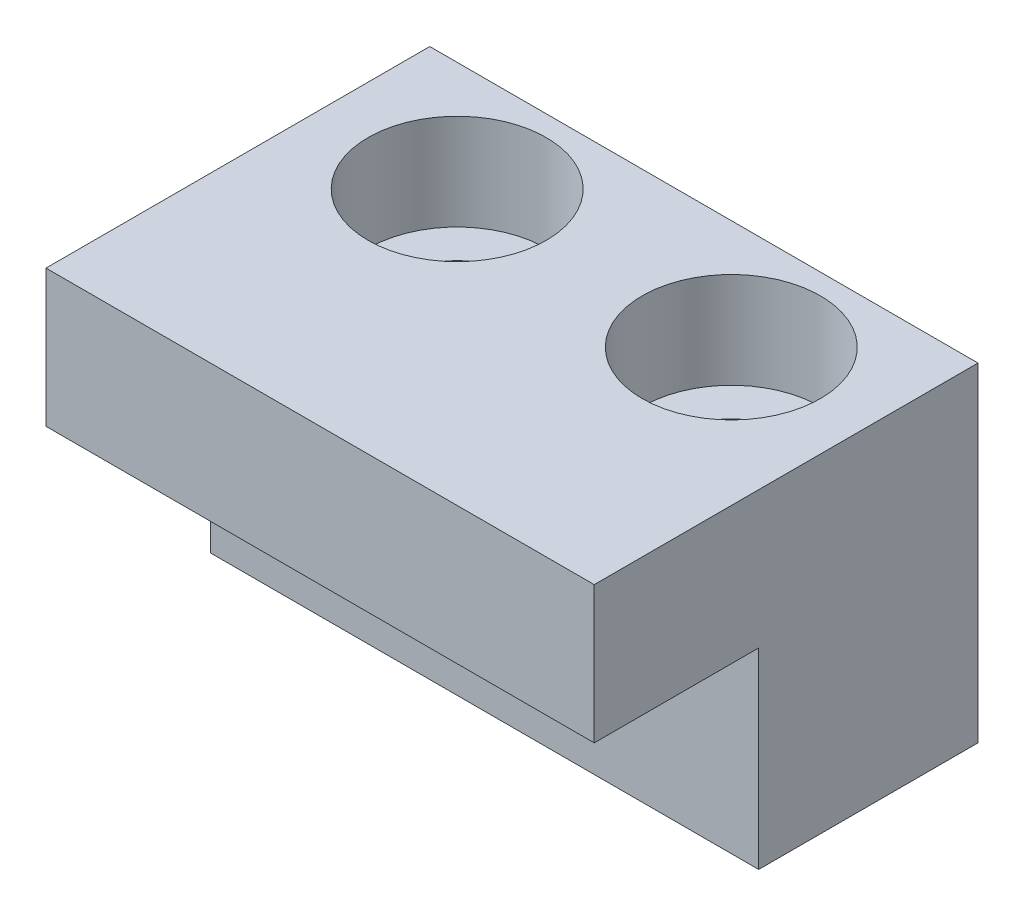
ISO-10303-21;
HEADER;
FILE_DESCRIPTION(('STEP AP214'),'2;1');
FILE_NAME('part.step','',(''),(''),'','','');
FILE_SCHEMA(('AUTOMOTIVE_DESIGN { 1 0 10303 214 1 1 1 1 }'));
ENDSEC;
DATA;
#1=APPLICATION_CONTEXT('core data for automotive mechanical design processes');
#2=APPLICATION_PROTOCOL_DEFINITION('international standard','automotive_design',2000,#1);
#3=PRODUCT_CONTEXT('',#1,'mechanical');
#4=PRODUCT('Part','Part','',(#3));
#5=PRODUCT_RELATED_PRODUCT_CATEGORY('part','',(#4));
#6=PRODUCT_DEFINITION_FORMATION('','',#4);
#7=PRODUCT_DEFINITION_CONTEXT('part definition',#1,'design');
#8=PRODUCT_DEFINITION('design','',#6,#7);
#9=PRODUCT_DEFINITION_SHAPE('','',#8);
#10=(LENGTH_UNIT() NAMED_UNIT(*) SI_UNIT(.MILLI.,.METRE.));
#11=(NAMED_UNIT(*) PLANE_ANGLE_UNIT() SI_UNIT($,.RADIAN.));
#12=(NAMED_UNIT(*) SI_UNIT($,.STERADIAN.) SOLID_ANGLE_UNIT());
#13=UNCERTAINTY_MEASURE_WITH_UNIT(LENGTH_MEASURE(1.E-05),#10,'distance_accuracy_value','');
#14=(GEOMETRIC_REPRESENTATION_CONTEXT(3) GLOBAL_UNCERTAINTY_ASSIGNED_CONTEXT((#13)) GLOBAL_UNIT_ASSIGNED_CONTEXT((#10,
#11,#12)) REPRESENTATION_CONTEXT('',''));
#15=CARTESIAN_POINT('',(0.,0.,0.));
#16=DIRECTION('',(0.,0.,1.));
#17=DIRECTION('',(1.,0.,0.));
#18=AXIS2_PLACEMENT_3D('',#15,#16,#17);
#19=CARTESIAN_POINT('',(15.,0.,4.));
#20=DIRECTION('',(0.,1.,0.));
#21=DIRECTION('',(0.,0.,1.));
#22=AXIS2_PLACEMENT_3D('',#19,#20,#21);
#23=CYLINDRICAL_SURFACE('',#22,1.75);
#24=CARTESIAN_POINT('',(15.,0.,4.));
#25=DIRECTION('',(0.,1.,0.));
#26=DIRECTION('',(0.,0.,1.));
#27=AXIS2_PLACEMENT_3D('',#24,#25,#26);
#28=CIRCLE('',#27,1.75);
#29=CARTESIAN_POINT('',(15.,0.,5.75));
#30=VERTEX_POINT('',#29);
#31=EDGE_CURVE('E113',#30,#30,#28,.T.);
#32=ORIENTED_EDGE('',*,*,#31,.F.);
#33=EDGE_LOOP('',(#32));
#34=FACE_BOUND('',#33,.T.);
#35=CARTESIAN_POINT('',(15.,8.5,4.));
#36=DIRECTION('',(0.,1.,0.));
#37=DIRECTION('',(0.,0.,1.));
#38=AXIS2_PLACEMENT_3D('',#35,#36,#37);
#39=CIRCLE('',#38,1.75);
#40=CARTESIAN_POINT('',(15.,8.5,5.75));
#41=VERTEX_POINT('',#40);
#42=EDGE_CURVE('E36',#41,#41,#39,.F.);
#43=ORIENTED_EDGE('',*,*,#42,.F.);
#44=EDGE_LOOP('',(#43));
#45=FACE_BOUND('',#44,.T.);
#46=ADVANCED_FACE('F32',(#34,#45),#23,.F.);
#47=CARTESIAN_POINT('',(5.,0.,4.));
#48=DIRECTION('',(0.,1.,0.));
#49=DIRECTION('',(0.,0.,1.));
#50=AXIS2_PLACEMENT_3D('',#47,#48,#49);
#51=CYLINDRICAL_SURFACE('',#50,1.75);
#52=CARTESIAN_POINT('',(5.,0.,4.));
#53=DIRECTION('',(0.,1.,0.));
#54=DIRECTION('',(0.,0.,1.));
#55=AXIS2_PLACEMENT_3D('',#52,#53,#54);
#56=CIRCLE('',#55,1.75);
#57=CARTESIAN_POINT('',(5.,0.,5.75));
#58=VERTEX_POINT('',#57);
#59=EDGE_CURVE('E118',#58,#58,#56,.T.);
#60=ORIENTED_EDGE('',*,*,#59,.F.);
#61=EDGE_LOOP('',(#60));
#62=FACE_BOUND('',#61,.T.);
#63=CARTESIAN_POINT('',(5.,8.5,4.));
#64=DIRECTION('',(0.,1.,0.));
#65=DIRECTION('',(0.,0.,1.));
#66=AXIS2_PLACEMENT_3D('',#63,#64,#65);
#67=CIRCLE('',#66,1.75);
#68=CARTESIAN_POINT('',(5.,8.5,5.75));
#69=VERTEX_POINT('',#68);
#70=EDGE_CURVE('E111',#69,#69,#67,.F.);
#71=ORIENTED_EDGE('',*,*,#70,.F.);
#72=EDGE_LOOP('',(#71));
#73=FACE_BOUND('',#72,.T.);
#74=ADVANCED_FACE('F175',(#62,#73),#51,.F.);
#75=CARTESIAN_POINT('',(0.,0.,14.));
#76=DIRECTION('',(0.,1.,0.));
#77=DIRECTION('',(0.,0.,1.));
#78=AXIS2_PLACEMENT_3D('',#75,#76,#77);
#79=PLANE('',#78);
#80=ORIENTED_EDGE('',*,*,#31,.T.);
#81=EDGE_LOOP('',(#80));
#82=FACE_BOUND('',#81,.T.);
#83=ORIENTED_EDGE('',*,*,#59,.T.);
#84=EDGE_LOOP('',(#83));
#85=FACE_BOUND('',#84,.T.);
#86=DIRECTION('',(0.,0.,-1.));
#87=VECTOR('',#86,1.);
#88=CARTESIAN_POINT('',(20.,0.,14.));
#89=LINE('',#88,#87);
#90=CARTESIAN_POINT('',(20.,0.,8.));
#91=VERTEX_POINT('',#90);
#92=CARTESIAN_POINT('',(20.,0.,0.));
#93=VERTEX_POINT('',#92);
#94=EDGE_CURVE('E106',#91,#93,#89,.T.);
#95=ORIENTED_EDGE('',*,*,#94,.F.);
#96=DIRECTION('',(-1.,0.,0.));
#97=VECTOR('',#96,1.);
#98=CARTESIAN_POINT('',(54.0036762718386,0.,8.));
#99=LINE('',#98,#97);
#100=CARTESIAN_POINT('',(0.,0.,8.));
#101=VERTEX_POINT('',#100);
#102=EDGE_CURVE('E103',#91,#101,#99,.T.);
#103=ORIENTED_EDGE('',*,*,#102,.T.);
#104=DIRECTION('',(0.,0.,-1.));
#105=VECTOR('',#104,1.);
#106=CARTESIAN_POINT('',(0.,0.,14.));
#107=LINE('',#106,#105);
#108=CARTESIAN_POINT('',(0.,0.,0.));
#109=VERTEX_POINT('',#108);
#110=EDGE_CURVE('E93',#101,#109,#107,.T.);
#111=ORIENTED_EDGE('',*,*,#110,.T.);
#112=DIRECTION('',(1.,0.,0.));
#113=VECTOR('',#112,1.);
#114=CARTESIAN_POINT('',(0.,0.,0.));
#115=LINE('',#114,#113);
#116=EDGE_CURVE('E138',#109,#93,#115,.T.);
#117=ORIENTED_EDGE('',*,*,#116,.T.);
#118=EDGE_LOOP('',(#95,#103,#111,#117));
#119=FACE_BOUND('',#118,.T.);
#120=ADVANCED_FACE('F34',(#82,#85,#119),#79,.F.);
#121=CARTESIAN_POINT('',(20.,0.,14.));
#122=DIRECTION('',(-1.,0.,0.));
#123=DIRECTION('',(0.,0.,1.));
#124=AXIS2_PLACEMENT_3D('',#121,#122,#123);
#125=PLANE('',#124);
#126=DIRECTION('',(0.,0.,-1.));
#127=VECTOR('',#126,1.);
#128=CARTESIAN_POINT('',(20.,7.,14.));
#129=LINE('',#128,#127);
#130=CARTESIAN_POINT('',(20.,7.,14.));
#131=VERTEX_POINT('',#130);
#132=CARTESIAN_POINT('',(20.,7.,8.));
#133=VERTEX_POINT('',#132);
#134=EDGE_CURVE('E49',#131,#133,#129,.T.);
#135=ORIENTED_EDGE('',*,*,#134,.T.);
#136=DIRECTION('',(0.,-1.,0.));
#137=VECTOR('',#136,1.);
#138=CARTESIAN_POINT('',(20.,0.,8.));
#139=LINE('',#138,#137);
#140=EDGE_CURVE('E53',#133,#91,#139,.T.);
#141=ORIENTED_EDGE('',*,*,#140,.T.);
#142=ORIENTED_EDGE('',*,*,#94,.T.);
#143=DIRECTION('',(0.,1.,0.));
#144=VECTOR('',#143,1.);
#145=CARTESIAN_POINT('',(20.,0.,0.));
#146=LINE('',#145,#144);
#147=CARTESIAN_POINT('',(20.,12.,0.));
#148=VERTEX_POINT('',#147);
#149=EDGE_CURVE('E145',#93,#148,#146,.T.);
#150=ORIENTED_EDGE('',*,*,#149,.T.);
#151=DIRECTION('',(0.,0.,-1.));
#152=VECTOR('',#151,1.);
#153=CARTESIAN_POINT('',(20.,12.,14.));
#154=LINE('',#153,#152);
#155=CARTESIAN_POINT('',(20.,12.,14.));
#156=VERTEX_POINT('',#155);
#157=EDGE_CURVE('E108',#156,#148,#154,.T.);
#158=ORIENTED_EDGE('',*,*,#157,.F.);
#159=DIRECTION('',(0.,1.,0.));
#160=VECTOR('',#159,1.);
#161=CARTESIAN_POINT('',(20.,0.,14.));
#162=LINE('',#161,#160);
#163=EDGE_CURVE('E139',#131,#156,#162,.T.);
#164=ORIENTED_EDGE('',*,*,#163,.F.);
#165=EDGE_LOOP('',(#135,#141,#142,#150,#158,#164));
#166=FACE_BOUND('',#165,.T.);
#167=ADVANCED_FACE('F167',(#166),#125,.F.);
#168=CARTESIAN_POINT('',(20.,12.,14.));
#169=DIRECTION('',(0.,-1.,0.));
#170=DIRECTION('',(0.,0.,-1.));
#171=AXIS2_PLACEMENT_3D('',#168,#169,#170);
#172=PLANE('',#171);
#173=CARTESIAN_POINT('',(15.,12.,4.));
#174=DIRECTION('',(0.,1.,0.));
#175=DIRECTION('',(0.,0.,1.));
#176=AXIS2_PLACEMENT_3D('',#173,#174,#175);
#177=CIRCLE('',#176,3.25);
#178=CARTESIAN_POINT('',(15.,12.,7.25));
#179=VERTEX_POINT('',#178);
#180=EDGE_CURVE('E128',#179,#179,#177,.T.);
#181=ORIENTED_EDGE('',*,*,#180,.F.);
#182=EDGE_LOOP('',(#181));
#183=FACE_BOUND('',#182,.T.);
#184=CARTESIAN_POINT('',(5.,12.,4.));
#185=DIRECTION('',(0.,1.,0.));
#186=DIRECTION('',(0.,0.,1.));
#187=AXIS2_PLACEMENT_3D('',#184,#185,#186);
#188=CIRCLE('',#187,3.25);
#189=CARTESIAN_POINT('',(5.,12.,7.25));
#190=VERTEX_POINT('',#189);
#191=EDGE_CURVE('E121',#190,#190,#188,.T.);
#192=ORIENTED_EDGE('',*,*,#191,.F.);
#193=EDGE_LOOP('',(#192));
#194=FACE_BOUND('',#193,.T.);
#195=DIRECTION('',(-1.,0.,0.));
#196=VECTOR('',#195,1.);
#197=CARTESIAN_POINT('',(20.,12.,0.));
#198=LINE('',#197,#196);
#199=CARTESIAN_POINT('',(0.,12.,0.));
#200=VERTEX_POINT('',#199);
#201=EDGE_CURVE('E147',#148,#200,#198,.T.);
#202=ORIENTED_EDGE('',*,*,#201,.T.);
#203=DIRECTION('',(0.,0.,-1.));
#204=VECTOR('',#203,1.);
#205=CARTESIAN_POINT('',(0.,12.,14.));
#206=LINE('',#205,#204);
#207=CARTESIAN_POINT('',(0.,12.,14.));
#208=VERTEX_POINT('',#207);
#209=EDGE_CURVE('E152',#208,#200,#206,.T.);
#210=ORIENTED_EDGE('',*,*,#209,.F.);
#211=DIRECTION('',(-1.,0.,0.));
#212=VECTOR('',#211,1.);
#213=CARTESIAN_POINT('',(20.,12.,14.));
#214=LINE('',#213,#212);
#215=EDGE_CURVE('E89',#156,#208,#214,.T.);
#216=ORIENTED_EDGE('',*,*,#215,.F.);
#217=ORIENTED_EDGE('',*,*,#157,.T.);
#218=EDGE_LOOP('',(#202,#210,#216,#217));
#219=FACE_BOUND('',#218,.T.);
#220=ADVANCED_FACE('F157',(#183,#194,#219),#172,.F.);
#221=CARTESIAN_POINT('',(0.,0.,14.));
#222=DIRECTION('',(1.,0.,0.));
#223=DIRECTION('',(0.,0.,-1.));
#224=AXIS2_PLACEMENT_3D('',#221,#222,#223);
#225=PLANE('',#224);
#226=ORIENTED_EDGE('',*,*,#110,.F.);
#227=DIRECTION('',(0.,1.,0.));
#228=VECTOR('',#227,1.);
#229=CARTESIAN_POINT('',(0.,0.,8.));
#230=LINE('',#229,#228);
#231=CARTESIAN_POINT('',(0.,7.,8.));
#232=VERTEX_POINT('',#231);
#233=EDGE_CURVE('E11',#101,#232,#230,.T.);
#234=ORIENTED_EDGE('',*,*,#233,.T.);
#235=DIRECTION('',(0.,0.,1.));
#236=VECTOR('',#235,1.);
#237=CARTESIAN_POINT('',(0.,7.,14.));
#238=LINE('',#237,#236);
#239=CARTESIAN_POINT('',(0.,7.,14.));
#240=VERTEX_POINT('',#239);
#241=EDGE_CURVE('E96',#232,#240,#238,.T.);
#242=ORIENTED_EDGE('',*,*,#241,.T.);
#243=DIRECTION('',(0.,-1.,0.));
#244=VECTOR('',#243,1.);
#245=CARTESIAN_POINT('',(0.,0.,14.));
#246=LINE('',#245,#244);
#247=EDGE_CURVE('E84',#208,#240,#246,.T.);
#248=ORIENTED_EDGE('',*,*,#247,.F.);
#249=ORIENTED_EDGE('',*,*,#209,.T.);
#250=DIRECTION('',(0.,-1.,0.));
#251=VECTOR('',#250,1.);
#252=CARTESIAN_POINT('',(0.,0.,0.));
#253=LINE('',#252,#251);
#254=EDGE_CURVE('E141',#200,#109,#253,.T.);
#255=ORIENTED_EDGE('',*,*,#254,.T.);
#256=EDGE_LOOP('',(#226,#234,#242,#248,#249,#255));
#257=FACE_BOUND('',#256,.T.);
#258=ADVANCED_FACE('F98',(#257),#225,.F.);
#259=CARTESIAN_POINT('',(20.,0.,14.));
#260=DIRECTION('',(0.,0.,1.));
#261=DIRECTION('',(1.,0.,0.));
#262=AXIS2_PLACEMENT_3D('',#259,#260,#261);
#263=PLANE('',#262);
#264=DIRECTION('',(-1.,0.,0.));
#265=VECTOR('',#264,1.);
#266=CARTESIAN_POINT('',(20.,7.,14.));
#267=LINE('',#266,#265);
#268=EDGE_CURVE('E41',#131,#240,#267,.T.);
#269=ORIENTED_EDGE('',*,*,#268,.F.);
#270=ORIENTED_EDGE('',*,*,#163,.T.);
#271=ORIENTED_EDGE('',*,*,#215,.T.);
#272=ORIENTED_EDGE('',*,*,#247,.T.);
#273=EDGE_LOOP('',(#269,#270,#271,#272));
#274=FACE_BOUND('',#273,.T.);
#275=ADVANCED_FACE('F86',(#274),#263,.T.);
#276=CARTESIAN_POINT('',(20.,0.,0.));
#277=DIRECTION('',(0.,0.,1.));
#278=DIRECTION('',(1.,0.,0.));
#279=AXIS2_PLACEMENT_3D('',#276,#277,#278);
#280=PLANE('',#279);
#281=ORIENTED_EDGE('',*,*,#116,.F.);
#282=ORIENTED_EDGE('',*,*,#254,.F.);
#283=ORIENTED_EDGE('',*,*,#201,.F.);
#284=ORIENTED_EDGE('',*,*,#149,.F.);
#285=EDGE_LOOP('',(#281,#282,#283,#284));
#286=FACE_BOUND('',#285,.T.);
#287=ADVANCED_FACE('F162',(#286),#280,.F.);
#288=CARTESIAN_POINT('',(54.0036762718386,0.,8.));
#289=DIRECTION('',(0.,0.,-1.));
#290=DIRECTION('',(-1.,0.,0.));
#291=AXIS2_PLACEMENT_3D('',#288,#289,#290);
#292=PLANE('',#291);
#293=ORIENTED_EDGE('',*,*,#140,.F.);
#294=DIRECTION('',(-1.,0.,0.));
#295=VECTOR('',#294,1.);
#296=CARTESIAN_POINT('',(54.0036762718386,7.,8.));
#297=LINE('',#296,#295);
#298=EDGE_CURVE('E133',#133,#232,#297,.T.);
#299=ORIENTED_EDGE('',*,*,#298,.T.);
#300=ORIENTED_EDGE('',*,*,#233,.F.);
#301=ORIENTED_EDGE('',*,*,#102,.F.);
#302=EDGE_LOOP('',(#293,#299,#300,#301));
#303=FACE_BOUND('',#302,.T.);
#304=ADVANCED_FACE('F166',(#303),#292,.F.);
#305=CARTESIAN_POINT('',(54.0036762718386,7.,14.));
#306=DIRECTION('',(0.,1.,0.));
#307=DIRECTION('',(0.,0.,1.));
#308=AXIS2_PLACEMENT_3D('',#305,#306,#307);
#309=PLANE('',#308);
#310=CARTESIAN_POINT('',(14.5,7.,11.));
#311=DIRECTION('',(0.,-1.,0.));
#312=DIRECTION('',(0.,0.,-1.));
#313=AXIS2_PLACEMENT_3D('',#310,#311,#312);
#314=CIRCLE('',#313,2.);
#315=CARTESIAN_POINT('',(14.5,7.,9.));
#316=VERTEX_POINT('',#315);
#317=EDGE_CURVE('E337',#316,#316,#314,.T.);
#318=ORIENTED_EDGE('',*,*,#317,.F.);
#319=EDGE_LOOP('',(#318));
#320=FACE_BOUND('',#319,.T.);
#321=CARTESIAN_POINT('',(5.5,7.,11.));
#322=DIRECTION('',(0.,-1.,0.));
#323=DIRECTION('',(0.,0.,-1.));
#324=AXIS2_PLACEMENT_3D('',#321,#322,#323);
#325=CIRCLE('',#324,2.);
#326=CARTESIAN_POINT('',(5.5,7.,9.));
#327=VERTEX_POINT('',#326);
#328=EDGE_CURVE('E336',#327,#327,#325,.T.);
#329=ORIENTED_EDGE('',*,*,#328,.F.);
#330=EDGE_LOOP('',(#329));
#331=FACE_BOUND('',#330,.T.);
#332=ORIENTED_EDGE('',*,*,#134,.F.);
#333=ORIENTED_EDGE('',*,*,#268,.T.);
#334=ORIENTED_EDGE('',*,*,#241,.F.);
#335=ORIENTED_EDGE('',*,*,#298,.F.);
#336=EDGE_LOOP('',(#332,#333,#334,#335));
#337=FACE_BOUND('',#336,.T.);
#338=ADVANCED_FACE('F105',(#320,#331,#337),#309,.F.);
#339=CARTESIAN_POINT('',(5.,8.5,4.));
#340=DIRECTION('',(0.,1.,0.));
#341=DIRECTION('',(0.,0.,1.));
#342=AXIS2_PLACEMENT_3D('',#339,#340,#341);
#343=PLANE('',#342);
#344=CARTESIAN_POINT('',(5.,8.5,4.));
#345=DIRECTION('',(0.,1.,0.));
#346=DIRECTION('',(0.,0.,1.));
#347=AXIS2_PLACEMENT_3D('',#344,#345,#346);
#348=CIRCLE('',#347,3.25);
#349=CARTESIAN_POINT('',(5.,8.5,7.25));
#350=VERTEX_POINT('',#349);
#351=EDGE_CURVE('E114',#350,#350,#348,.T.);
#352=ORIENTED_EDGE('',*,*,#351,.T.);
#353=EDGE_LOOP('',(#352));
#354=FACE_BOUND('',#353,.T.);
#355=ORIENTED_EDGE('',*,*,#70,.T.);
#356=EDGE_LOOP('',(#355));
#357=FACE_BOUND('',#356,.T.);
#358=ADVANCED_FACE('F193',(#354,#357),#343,.T.);
#359=CARTESIAN_POINT('',(5.,8.5,4.));
#360=DIRECTION('',(0.,1.,0.));
#361=DIRECTION('',(0.,0.,1.));
#362=AXIS2_PLACEMENT_3D('',#359,#360,#361);
#363=CYLINDRICAL_SURFACE('',#362,3.25);
#364=ORIENTED_EDGE('',*,*,#351,.F.);
#365=EDGE_LOOP('',(#364));
#366=FACE_BOUND('',#365,.T.);
#367=ORIENTED_EDGE('',*,*,#191,.T.);
#368=EDGE_LOOP('',(#367));
#369=FACE_BOUND('',#368,.T.);
#370=ADVANCED_FACE('F188',(#366,#369),#363,.F.);
#371=CARTESIAN_POINT('',(15.,8.5,4.));
#372=DIRECTION('',(0.,1.,0.));
#373=DIRECTION('',(0.,0.,1.));
#374=AXIS2_PLACEMENT_3D('',#371,#372,#373);
#375=PLANE('',#374);
#376=CARTESIAN_POINT('',(15.,8.5,4.));
#377=DIRECTION('',(0.,1.,0.));
#378=DIRECTION('',(0.,0.,1.));
#379=AXIS2_PLACEMENT_3D('',#376,#377,#378);
#380=CIRCLE('',#379,3.25);
#381=CARTESIAN_POINT('',(15.,8.5,7.25));
#382=VERTEX_POINT('',#381);
#383=EDGE_CURVE('E346',#382,#382,#380,.T.);
#384=ORIENTED_EDGE('',*,*,#383,.T.);
#385=EDGE_LOOP('',(#384));
#386=FACE_BOUND('',#385,.T.);
#387=ORIENTED_EDGE('',*,*,#42,.T.);
#388=EDGE_LOOP('',(#387));
#389=FACE_BOUND('',#388,.T.);
#390=ADVANCED_FACE('F236',(#386,#389),#375,.T.);
#391=CARTESIAN_POINT('',(15.,8.5,4.));
#392=DIRECTION('',(0.,1.,0.));
#393=DIRECTION('',(0.,0.,1.));
#394=AXIS2_PLACEMENT_3D('',#391,#392,#393);
#395=CYLINDRICAL_SURFACE('',#394,3.25);
#396=ORIENTED_EDGE('',*,*,#383,.F.);
#397=EDGE_LOOP('',(#396));
#398=FACE_BOUND('',#397,.T.);
#399=ORIENTED_EDGE('',*,*,#180,.T.);
#400=EDGE_LOOP('',(#399));
#401=FACE_BOUND('',#400,.T.);
#402=ADVANCED_FACE('F243',(#398,#401),#395,.F.);
#403=CARTESIAN_POINT('',(5.5,10.5,11.));
#404=DIRECTION('',(0.,-1.,0.));
#405=DIRECTION('',(0.,0.,-1.));
#406=AXIS2_PLACEMENT_3D('',#403,#404,#405);
#407=CYLINDRICAL_SURFACE('',#406,2.);
#408=CARTESIAN_POINT('',(5.5,10.5,11.));
#409=DIRECTION('',(0.,-1.,0.));
#410=DIRECTION('',(0.,0.,-1.));
#411=AXIS2_PLACEMENT_3D('',#408,#409,#410);
#412=CIRCLE('',#411,2.);
#413=CARTESIAN_POINT('',(5.5,10.5,9.));
#414=VERTEX_POINT('',#413);
#415=EDGE_CURVE('E340',#414,#414,#412,.T.);
#416=ORIENTED_EDGE('',*,*,#415,.F.);
#417=EDGE_LOOP('',(#416));
#418=FACE_BOUND('',#417,.T.);
#419=ORIENTED_EDGE('',*,*,#328,.T.);
#420=EDGE_LOOP('',(#419));
#421=FACE_BOUND('',#420,.T.);
#422=ADVANCED_FACE('F250',(#418,#421),#407,.F.);
#423=CARTESIAN_POINT('',(5.5,10.5,11.));
#424=DIRECTION('',(0.,-1.,0.));
#425=DIRECTION('',(0.,0.,-1.));
#426=AXIS2_PLACEMENT_3D('',#423,#424,#425);
#427=PLANE('',#426);
#428=ORIENTED_EDGE('',*,*,#415,.T.);
#429=EDGE_LOOP('',(#428));
#430=FACE_BOUND('',#429,.T.);
#431=ADVANCED_FACE('F257',(#430),#427,.T.);
#432=CARTESIAN_POINT('',(14.5,10.5,11.));
#433=DIRECTION('',(0.,-1.,0.));
#434=DIRECTION('',(0.,0.,-1.));
#435=AXIS2_PLACEMENT_3D('',#432,#433,#434);
#436=CYLINDRICAL_SURFACE('',#435,2.);
#437=CARTESIAN_POINT('',(14.5,10.5,11.));
#438=DIRECTION('',(0.,-1.,0.));
#439=DIRECTION('',(0.,0.,-1.));
#440=AXIS2_PLACEMENT_3D('',#437,#438,#439);
#441=CIRCLE('',#440,2.);
#442=CARTESIAN_POINT('',(14.5,10.5,9.));
#443=VERTEX_POINT('',#442);
#444=EDGE_CURVE('E335',#443,#443,#441,.T.);
#445=ORIENTED_EDGE('',*,*,#444,.F.);
#446=EDGE_LOOP('',(#445));
#447=FACE_BOUND('',#446,.T.);
#448=ORIENTED_EDGE('',*,*,#317,.T.);
#449=EDGE_LOOP('',(#448));
#450=FACE_BOUND('',#449,.T.);
#451=ADVANCED_FACE('F265',(#447,#450),#436,.F.);
#452=CARTESIAN_POINT('',(14.5,10.5,11.));
#453=DIRECTION('',(0.,-1.,0.));
#454=DIRECTION('',(0.,0.,-1.));
#455=AXIS2_PLACEMENT_3D('',#452,#453,#454);
#456=PLANE('',#455);
#457=ORIENTED_EDGE('',*,*,#444,.T.);
#458=EDGE_LOOP('',(#457));
#459=FACE_BOUND('',#458,.T.);
#460=ADVANCED_FACE('F273',(#459),#456,.T.);
#461=CLOSED_SHELL('',(#46,#74,#120,#167,#220,#258,#275,#287,#304,#338,#358,#370,#390,#402,#422,
#431,#451,#460));
#462=MANIFOLD_SOLID_BREP('B2',#461);
#463=ADVANCED_BREP_SHAPE_REPRESENTATION('',(#18,#462),#14);
#464=SHAPE_DEFINITION_REPRESENTATION(#9,#463);
ENDSEC;
END-ISO-10303-21;
